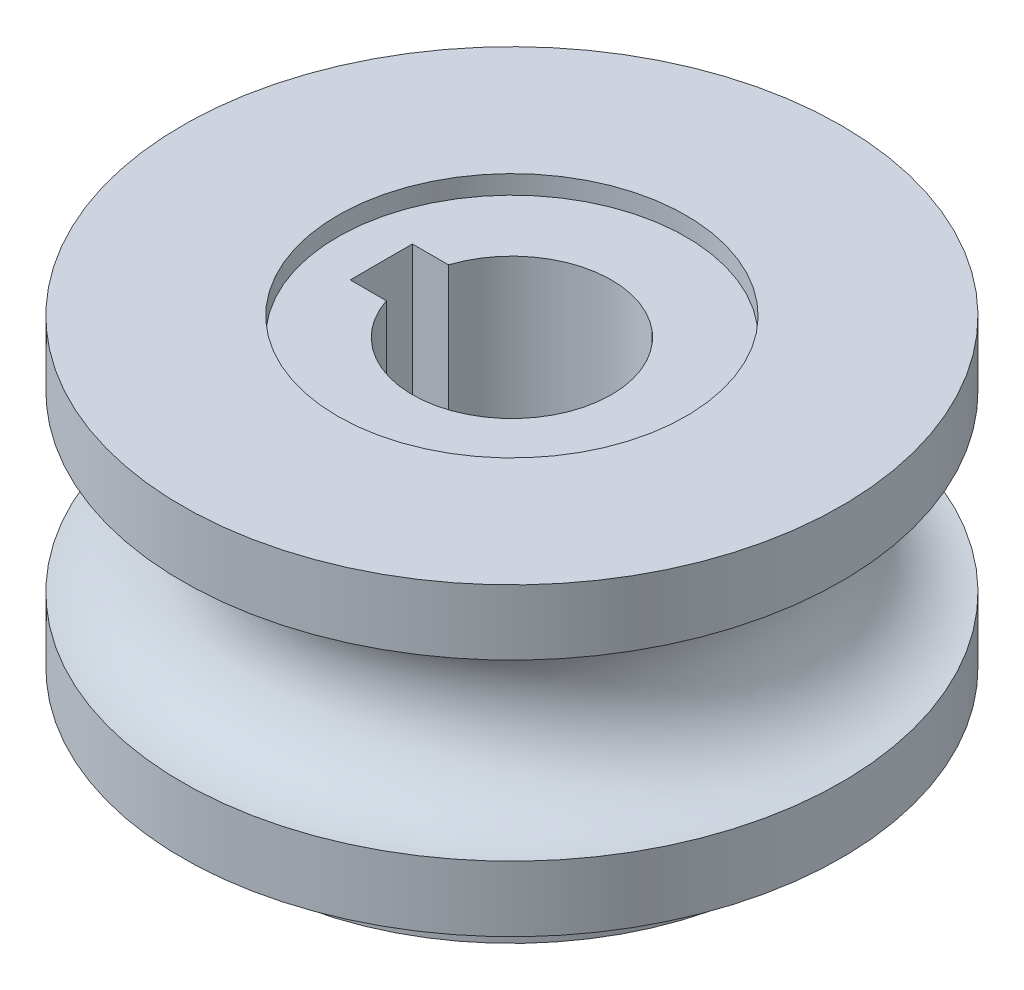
ISO-10303-21;
HEADER;
FILE_DESCRIPTION(('STEP AP214'),'2;1');
FILE_NAME('part.step','',(''),(''),'','','');
FILE_SCHEMA(('AUTOMOTIVE_DESIGN { 1 0 10303 214 1 1 1 1 }'));
ENDSEC;
DATA;
#1=APPLICATION_CONTEXT('core data for automotive mechanical design processes');
#2=APPLICATION_PROTOCOL_DEFINITION('international standard','automotive_design',2000,#1);
#3=PRODUCT_CONTEXT('',#1,'mechanical');
#4=PRODUCT('Part','Part','',(#3));
#5=PRODUCT_RELATED_PRODUCT_CATEGORY('part','',(#4));
#6=PRODUCT_DEFINITION_FORMATION('','',#4);
#7=PRODUCT_DEFINITION_CONTEXT('part definition',#1,'design');
#8=PRODUCT_DEFINITION('design','',#6,#7);
#9=PRODUCT_DEFINITION_SHAPE('','',#8);
#10=(LENGTH_UNIT() NAMED_UNIT(*) SI_UNIT(.MILLI.,.METRE.));
#11=(NAMED_UNIT(*) PLANE_ANGLE_UNIT() SI_UNIT($,.RADIAN.));
#12=(NAMED_UNIT(*) SI_UNIT($,.STERADIAN.) SOLID_ANGLE_UNIT());
#13=UNCERTAINTY_MEASURE_WITH_UNIT(LENGTH_MEASURE(1.E-05),#10,'distance_accuracy_value','');
#14=(GEOMETRIC_REPRESENTATION_CONTEXT(3) GLOBAL_UNCERTAINTY_ASSIGNED_CONTEXT((#13)) GLOBAL_UNIT_ASSIGNED_CONTEXT((#10,
#11,#12)) REPRESENTATION_CONTEXT('',''));
#15=CARTESIAN_POINT('',(0.,0.,0.));
#16=DIRECTION('',(0.,0.,1.));
#17=DIRECTION('',(1.,0.,0.));
#18=AXIS2_PLACEMENT_3D('',#15,#16,#17);
#19=CARTESIAN_POINT('',(0.,0.,0.));
#20=DIRECTION('',(0.,-1.,0.));
#21=DIRECTION('',(0.,0.,-1.));
#22=AXIS2_PLACEMENT_3D('',#19,#20,#21);
#23=PLANE('',#22);
#24=DIRECTION('',(-1.,0.,0.));
#25=VECTOR('',#24,1.);
#26=CARTESIAN_POINT('',(-5.25,0.,-1.25));
#27=LINE('',#26,#25);
#28=CARTESIAN_POINT('',(-4.58257569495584,0.,-1.25));
#29=VERTEX_POINT('',#28);
#30=CARTESIAN_POINT('',(-5.25,0.,-1.25));
#31=VERTEX_POINT('',#30);
#32=EDGE_CURVE('E91',#29,#31,#27,.T.);
#33=ORIENTED_EDGE('',*,*,#32,.T.);
#34=DIRECTION('',(0.,0.,1.));
#35=VECTOR('',#34,1.);
#36=CARTESIAN_POINT('',(-5.25,0.,-1.25));
#37=LINE('',#36,#35);
#38=CARTESIAN_POINT('',(-5.25,0.,1.25));
#39=VERTEX_POINT('',#38);
#40=EDGE_CURVE('E107',#31,#39,#37,.T.);
#41=ORIENTED_EDGE('',*,*,#40,.T.);
#42=DIRECTION('',(1.,0.,0.));
#43=VECTOR('',#42,1.);
#44=CARTESIAN_POINT('',(-5.25,0.,1.25));
#45=LINE('',#44,#43);
#46=CARTESIAN_POINT('',(-4.58257569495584,0.,1.25));
#47=VERTEX_POINT('',#46);
#48=EDGE_CURVE('E86',#39,#47,#45,.T.);
#49=ORIENTED_EDGE('',*,*,#48,.T.);
#50=CARTESIAN_POINT('',(0.,0.,0.));
#51=DIRECTION('',(0.,-1.,0.));
#52=DIRECTION('',(0.,0.,-1.));
#53=AXIS2_PLACEMENT_3D('',#50,#51,#52);
#54=CIRCLE('',#53,4.75);
#55=EDGE_CURVE('E133',#29,#47,#54,.T.);
#56=ORIENTED_EDGE('',*,*,#55,.F.);
#57=EDGE_LOOP('',(#33,#41,#49,#56));
#58=FACE_BOUND('',#57,.T.);
#59=CARTESIAN_POINT('',(0.,0.,0.));
#60=DIRECTION('',(0.,-1.,0.));
#61=DIRECTION('',(0.,0.,-1.));
#62=AXIS2_PLACEMENT_3D('',#59,#60,#61);
#63=CIRCLE('',#62,6.5);
#64=CARTESIAN_POINT('',(0.,0.,-6.5));
#65=VERTEX_POINT('',#64);
#66=EDGE_CURVE('E160',#65,#65,#63,.T.);
#67=ORIENTED_EDGE('',*,*,#66,.T.);
#68=EDGE_LOOP('',(#67));
#69=FACE_BOUND('',#68,.T.);
#70=ADVANCED_FACE('F32',(#58,#69),#23,.T.);
#71=CARTESIAN_POINT('',(0.,0.,0.));
#72=DIRECTION('',(0.,-1.,0.));
#73=DIRECTION('',(0.,0.,-1.));
#74=AXIS2_PLACEMENT_3D('',#71,#72,#73);
#75=CYLINDRICAL_SURFACE('',#74,6.5);
#76=CARTESIAN_POINT('',(0.,0.5,0.));
#77=DIRECTION('',(0.,-1.,0.));
#78=DIRECTION('',(0.,0.,-1.));
#79=AXIS2_PLACEMENT_3D('',#76,#77,#78);
#80=CIRCLE('',#79,6.5);
#81=CARTESIAN_POINT('',(0.,0.5,-6.5));
#82=VERTEX_POINT('',#81);
#83=EDGE_CURVE('E157',#82,#82,#80,.T.);
#84=ORIENTED_EDGE('',*,*,#83,.T.);
#85=EDGE_LOOP('',(#84));
#86=FACE_BOUND('',#85,.T.);
#87=ORIENTED_EDGE('',*,*,#66,.F.);
#88=EDGE_LOOP('',(#87));
#89=FACE_BOUND('',#88,.T.);
#90=ADVANCED_FACE('F184',(#86,#89),#75,.T.);
#91=CARTESIAN_POINT('',(6.5,0.5,0.));
#92=DIRECTION('',(0.,-1.,0.));
#93=DIRECTION('',(0.,0.,-1.));
#94=AXIS2_PLACEMENT_3D('',#91,#92,#93);
#95=PLANE('',#94);
#96=CARTESIAN_POINT('',(0.,0.5,0.));
#97=DIRECTION('',(0.,-1.,0.));
#98=DIRECTION('',(0.,0.,-1.));
#99=AXIS2_PLACEMENT_3D('',#96,#97,#98);
#100=CIRCLE('',#99,10.75);
#101=CARTESIAN_POINT('',(0.,0.5,-10.75));
#102=VERTEX_POINT('',#101);
#103=EDGE_CURVE('E154',#102,#102,#100,.T.);
#104=ORIENTED_EDGE('',*,*,#103,.T.);
#105=EDGE_LOOP('',(#104));
#106=FACE_BOUND('',#105,.T.);
#107=ORIENTED_EDGE('',*,*,#83,.F.);
#108=EDGE_LOOP('',(#107));
#109=FACE_BOUND('',#108,.T.);
#110=ADVANCED_FACE('F188',(#106,#109),#95,.T.);
#111=CARTESIAN_POINT('',(0.,0.,0.));
#112=DIRECTION('',(0.,-1.,0.));
#113=DIRECTION('',(0.,0.,-1.));
#114=AXIS2_PLACEMENT_3D('',#111,#112,#113);
#115=CYLINDRICAL_SURFACE('',#114,10.75);
#116=CARTESIAN_POINT('',(0.,2.5,0.));
#117=DIRECTION('',(0.,-1.,0.));
#118=DIRECTION('',(0.,0.,-1.));
#119=AXIS2_PLACEMENT_3D('',#116,#117,#118);
#120=CIRCLE('',#119,10.75);
#121=CARTESIAN_POINT('',(0.,2.5,-10.75));
#122=VERTEX_POINT('',#121);
#123=EDGE_CURVE('E151',#122,#122,#120,.T.);
#124=ORIENTED_EDGE('',*,*,#123,.T.);
#125=EDGE_LOOP('',(#124));
#126=FACE_BOUND('',#125,.T.);
#127=ORIENTED_EDGE('',*,*,#103,.F.);
#128=EDGE_LOOP('',(#127));
#129=FACE_BOUND('',#128,.T.);
#130=ADVANCED_FACE('F193',(#126,#129),#115,.T.);
#131=CARTESIAN_POINT('',(10.75,2.5,0.));
#132=DIRECTION('',(0.,-1.,0.));
#133=DIRECTION('',(0.,0.,-1.));
#134=AXIS2_PLACEMENT_3D('',#131,#132,#133);
#135=PLANE('',#134);
#136=CARTESIAN_POINT('',(0.,2.5,0.));
#137=DIRECTION('',(0.,-1.,0.));
#138=DIRECTION('',(0.,0.,-1.));
#139=AXIS2_PLACEMENT_3D('',#136,#137,#138);
#140=CIRCLE('',#139,13.25);
#141=CARTESIAN_POINT('',(0.,2.5,-13.25));
#142=VERTEX_POINT('',#141);
#143=EDGE_CURVE('E148',#142,#142,#140,.T.);
#144=ORIENTED_EDGE('',*,*,#143,.T.);
#145=EDGE_LOOP('',(#144));
#146=FACE_BOUND('',#145,.T.);
#147=ORIENTED_EDGE('',*,*,#123,.F.);
#148=EDGE_LOOP('',(#147));
#149=FACE_BOUND('',#148,.T.);
#150=ADVANCED_FACE('F200',(#146,#149),#135,.T.);
#151=CARTESIAN_POINT('',(0.,0.,0.));
#152=DIRECTION('',(0.,-1.,0.));
#153=DIRECTION('',(0.,0.,-1.));
#154=AXIS2_PLACEMENT_3D('',#151,#152,#153);
#155=CYLINDRICAL_SURFACE('',#154,13.25);
#156=CARTESIAN_POINT('',(0.,5.13,0.));
#157=DIRECTION('',(0.,-1.,0.));
#158=DIRECTION('',(0.,0.,-1.));
#159=AXIS2_PLACEMENT_3D('',#156,#157,#158);
#160=CIRCLE('',#159,13.25);
#161=CARTESIAN_POINT('',(0.,5.13,-13.25));
#162=VERTEX_POINT('',#161);
#163=EDGE_CURVE('E145',#162,#162,#160,.T.);
#164=ORIENTED_EDGE('',*,*,#163,.T.);
#165=EDGE_LOOP('',(#164));
#166=FACE_BOUND('',#165,.T.);
#167=ORIENTED_EDGE('',*,*,#143,.F.);
#168=EDGE_LOOP('',(#167));
#169=FACE_BOUND('',#168,.T.);
#170=ADVANCED_FACE('F204',(#166,#169),#155,.T.);
#171=CARTESIAN_POINT('',(0.,8.63,0.));
#172=DIRECTION('',(0.,-1.,0.));
#173=DIRECTION('',(0.,0.,-1.));
#174=AXIS2_PLACEMENT_3D('',#171,#172,#173);
#175=TOROIDAL_SURFACE('',#174,13.25,3.5);
#176=CARTESIAN_POINT('',(0.,12.13,0.));
#177=DIRECTION('',(0.,-1.,0.));
#178=DIRECTION('',(0.,0.,-1.));
#179=AXIS2_PLACEMENT_3D('',#176,#177,#178);
#180=CIRCLE('',#179,13.25);
#181=CARTESIAN_POINT('',(0.,12.13,-13.25));
#182=VERTEX_POINT('',#181);
#183=EDGE_CURVE('E142',#182,#182,#180,.T.);
#184=ORIENTED_EDGE('',*,*,#183,.T.);
#185=EDGE_LOOP('',(#184));
#186=FACE_BOUND('',#185,.T.);
#187=ORIENTED_EDGE('',*,*,#163,.F.);
#188=EDGE_LOOP('',(#187));
#189=FACE_BOUND('',#188,.T.);
#190=ADVANCED_FACE('F208',(#186,#189),#175,.F.);
#191=CARTESIAN_POINT('',(0.,0.,0.));
#192=DIRECTION('',(0.,-1.,0.));
#193=DIRECTION('',(0.,0.,-1.));
#194=AXIS2_PLACEMENT_3D('',#191,#192,#193);
#195=CYLINDRICAL_SURFACE('',#194,13.25);
#196=CARTESIAN_POINT('',(0.,14.75,0.));
#197=DIRECTION('',(0.,-1.,0.));
#198=DIRECTION('',(0.,0.,-1.));
#199=AXIS2_PLACEMENT_3D('',#196,#197,#198);
#200=CIRCLE('',#199,13.25);
#201=CARTESIAN_POINT('',(0.,14.75,-13.25));
#202=VERTEX_POINT('',#201);
#203=EDGE_CURVE('E139',#202,#202,#200,.T.);
#204=ORIENTED_EDGE('',*,*,#203,.T.);
#205=EDGE_LOOP('',(#204));
#206=FACE_BOUND('',#205,.T.);
#207=ORIENTED_EDGE('',*,*,#183,.F.);
#208=EDGE_LOOP('',(#207));
#209=FACE_BOUND('',#208,.T.);
#210=ADVANCED_FACE('F212',(#206,#209),#195,.T.);
#211=CARTESIAN_POINT('',(13.25,14.75,0.));
#212=DIRECTION('',(0.,1.,0.));
#213=DIRECTION('',(0.,0.,1.));
#214=AXIS2_PLACEMENT_3D('',#211,#212,#213);
#215=PLANE('',#214);
#216=CARTESIAN_POINT('',(0.,14.75,0.));
#217=DIRECTION('',(0.,1.,0.));
#218=DIRECTION('',(0.,0.,1.));
#219=AXIS2_PLACEMENT_3D('',#216,#217,#218);
#220=CIRCLE('',#219,7.);
#221=CARTESIAN_POINT('',(0.,14.75,7.));
#222=VERTEX_POINT('',#221);
#223=EDGE_CURVE('E127',#222,#222,#220,.T.);
#224=ORIENTED_EDGE('',*,*,#223,.F.);
#225=EDGE_LOOP('',(#224));
#226=FACE_BOUND('',#225,.T.);
#227=ORIENTED_EDGE('',*,*,#203,.F.);
#228=EDGE_LOOP('',(#227));
#229=FACE_BOUND('',#228,.T.);
#230=ADVANCED_FACE('F216',(#226,#229),#215,.T.);
#231=CARTESIAN_POINT('',(0.,0.75,0.));
#232=DIRECTION('',(0.,-1.,0.));
#233=DIRECTION('',(0.,0.,-1.));
#234=AXIS2_PLACEMENT_3D('',#231,#232,#233);
#235=CYLINDRICAL_SURFACE('',#234,4.75);
#236=CARTESIAN_POINT('',(0.,0.75,0.));
#237=DIRECTION('',(0.,-1.,0.));
#238=DIRECTION('',(0.,0.,-1.));
#239=AXIS2_PLACEMENT_3D('',#236,#237,#238);
#240=CIRCLE('',#239,4.75);
#241=CARTESIAN_POINT('',(-4.58257569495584,0.75,-1.25));
#242=VERTEX_POINT('',#241);
#243=CARTESIAN_POINT('',(-4.58257569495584,0.75,1.25));
#244=VERTEX_POINT('',#243);
#245=EDGE_CURVE('E136',#242,#244,#240,.T.);
#246=ORIENTED_EDGE('',*,*,#245,.F.);
#247=DIRECTION('',(0.,-1.,0.));
#248=VECTOR('',#247,1.);
#249=CARTESIAN_POINT('',(-4.58257569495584,0.75,-1.25));
#250=LINE('',#249,#248);
#251=EDGE_CURVE('E54',#242,#29,#250,.T.);
#252=ORIENTED_EDGE('',*,*,#251,.T.);
#253=ORIENTED_EDGE('',*,*,#55,.T.);
#254=DIRECTION('',(0.,-1.,0.));
#255=VECTOR('',#254,1.);
#256=CARTESIAN_POINT('',(-4.58257569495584,0.75,1.25));
#257=LINE('',#256,#255);
#258=EDGE_CURVE('E117',#47,#244,#257,.F.);
#259=ORIENTED_EDGE('',*,*,#258,.T.);
#260=EDGE_LOOP('',(#246,#252,#253,#259));
#261=FACE_BOUND('',#260,.T.);
#262=ADVANCED_FACE('F170',(#261),#235,.F.);
#263=CARTESIAN_POINT('',(0.,0.75,0.));
#264=DIRECTION('',(0.,-1.,0.));
#265=DIRECTION('',(0.,0.,-1.));
#266=AXIS2_PLACEMENT_3D('',#263,#264,#265);
#267=PLANE('',#266);
#268=DIRECTION('',(1.,0.,0.));
#269=VECTOR('',#268,1.);
#270=CARTESIAN_POINT('',(0.,0.75,-1.25));
#271=LINE('',#270,#269);
#272=CARTESIAN_POINT('',(-3.79967103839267,0.75,-1.25));
#273=VERTEX_POINT('',#272);
#274=EDGE_CURVE('E120',#242,#273,#271,.T.);
#275=ORIENTED_EDGE('',*,*,#274,.F.);
#276=ORIENTED_EDGE('',*,*,#245,.T.);
#277=DIRECTION('',(-1.,0.,0.));
#278=VECTOR('',#277,1.);
#279=CARTESIAN_POINT('',(0.,0.75,1.25));
#280=LINE('',#279,#278);
#281=CARTESIAN_POINT('',(-3.79967103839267,0.75,1.25));
#282=VERTEX_POINT('',#281);
#283=EDGE_CURVE('E114',#282,#244,#280,.T.);
#284=ORIENTED_EDGE('',*,*,#283,.F.);
#285=CARTESIAN_POINT('',(0.,0.75,0.));
#286=DIRECTION('',(0.,-1.,0.));
#287=DIRECTION('',(0.,0.,-1.));
#288=AXIS2_PLACEMENT_3D('',#285,#286,#287);
#289=CIRCLE('',#288,4.);
#290=EDGE_CURVE('E124',#273,#282,#289,.T.);
#291=ORIENTED_EDGE('',*,*,#290,.F.);
#292=EDGE_LOOP('',(#275,#276,#284,#291));
#293=FACE_BOUND('',#292,.T.);
#294=ADVANCED_FACE('F167',(#293),#267,.T.);
#295=CARTESIAN_POINT('',(0.,14.,0.));
#296=DIRECTION('',(0.,1.,0.));
#297=DIRECTION('',(0.,0.,1.));
#298=AXIS2_PLACEMENT_3D('',#295,#296,#297);
#299=CYLINDRICAL_SURFACE('',#298,7.);
#300=CARTESIAN_POINT('',(0.,14.,0.));
#301=DIRECTION('',(0.,1.,0.));
#302=DIRECTION('',(0.,0.,1.));
#303=AXIS2_PLACEMENT_3D('',#300,#301,#302);
#304=CIRCLE('',#303,7.);
#305=CARTESIAN_POINT('',(0.,14.,7.));
#306=VERTEX_POINT('',#305);
#307=EDGE_CURVE('E130',#306,#306,#304,.T.);
#308=ORIENTED_EDGE('',*,*,#307,.F.);
#309=EDGE_LOOP('',(#308));
#310=FACE_BOUND('',#309,.T.);
#311=ORIENTED_EDGE('',*,*,#223,.T.);
#312=EDGE_LOOP('',(#311));
#313=FACE_BOUND('',#312,.T.);
#314=ADVANCED_FACE('F225',(#310,#313),#299,.F.);
#315=CARTESIAN_POINT('',(0.,14.,0.));
#316=DIRECTION('',(0.,1.,0.));
#317=DIRECTION('',(0.,0.,1.));
#318=AXIS2_PLACEMENT_3D('',#315,#316,#317);
#319=PLANE('',#318);
#320=DIRECTION('',(-1.,0.,0.));
#321=VECTOR('',#320,1.);
#322=CARTESIAN_POINT('',(-5.25,14.,-1.25));
#323=LINE('',#322,#321);
#324=CARTESIAN_POINT('',(-3.79967103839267,14.,-1.25));
#325=VERTEX_POINT('',#324);
#326=CARTESIAN_POINT('',(-5.25,14.,-1.25));
#327=VERTEX_POINT('',#326);
#328=EDGE_CURVE('E105',#325,#327,#323,.T.);
#329=ORIENTED_EDGE('',*,*,#328,.F.);
#330=CARTESIAN_POINT('',(0.,14.,0.));
#331=DIRECTION('',(0.,1.,0.));
#332=DIRECTION('',(0.,0.,1.));
#333=AXIS2_PLACEMENT_3D('',#330,#331,#332);
#334=CIRCLE('',#333,4.);
#335=CARTESIAN_POINT('',(-3.79967103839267,14.,1.25));
#336=VERTEX_POINT('',#335);
#337=EDGE_CURVE('E104',#336,#325,#334,.T.);
#338=ORIENTED_EDGE('',*,*,#337,.F.);
#339=DIRECTION('',(1.,0.,0.));
#340=VECTOR('',#339,1.);
#341=CARTESIAN_POINT('',(-5.25,14.,1.25));
#342=LINE('',#341,#340);
#343=CARTESIAN_POINT('',(-5.25,14.,1.25));
#344=VERTEX_POINT('',#343);
#345=EDGE_CURVE('E46',#344,#336,#342,.T.);
#346=ORIENTED_EDGE('',*,*,#345,.F.);
#347=DIRECTION('',(0.,0.,1.));
#348=VECTOR('',#347,1.);
#349=CARTESIAN_POINT('',(-5.25,14.,-1.25));
#350=LINE('',#349,#348);
#351=EDGE_CURVE('E94',#327,#344,#350,.T.);
#352=ORIENTED_EDGE('',*,*,#351,.F.);
#353=EDGE_LOOP('',(#329,#338,#346,#352));
#354=FACE_BOUND('',#353,.T.);
#355=ORIENTED_EDGE('',*,*,#307,.T.);
#356=EDGE_LOOP('',(#355));
#357=FACE_BOUND('',#356,.T.);
#358=ADVANCED_FACE('F101',(#354,#357),#319,.T.);
#359=CARTESIAN_POINT('',(0.,0.,0.));
#360=DIRECTION('',(0.,1.,0.));
#361=DIRECTION('',(0.,0.,1.));
#362=AXIS2_PLACEMENT_3D('',#359,#360,#361);
#363=CYLINDRICAL_SURFACE('',#362,4.);
#364=ORIENTED_EDGE('',*,*,#337,.T.);
#365=DIRECTION('',(0.,1.,0.));
#366=VECTOR('',#365,1.);
#367=CARTESIAN_POINT('',(-3.79967103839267,0.,-1.25));
#368=LINE('',#367,#366);
#369=EDGE_CURVE('E11',#325,#273,#368,.F.);
#370=ORIENTED_EDGE('',*,*,#369,.T.);
#371=ORIENTED_EDGE('',*,*,#290,.T.);
#372=DIRECTION('',(0.,1.,0.));
#373=VECTOR('',#372,1.);
#374=CARTESIAN_POINT('',(-3.79967103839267,0.,1.25));
#375=LINE('',#374,#373);
#376=EDGE_CURVE('E39',#282,#336,#375,.T.);
#377=ORIENTED_EDGE('',*,*,#376,.T.);
#378=EDGE_LOOP('',(#364,#370,#371,#377));
#379=FACE_BOUND('',#378,.T.);
#380=ADVANCED_FACE('F163',(#379),#363,.F.);
#381=CARTESIAN_POINT('',(-5.25,0.,-1.25));
#382=DIRECTION('',(0.,0.,-1.));
#383=DIRECTION('',(-1.,0.,0.));
#384=AXIS2_PLACEMENT_3D('',#381,#382,#383);
#385=PLANE('',#384);
#386=ORIENTED_EDGE('',*,*,#274,.T.);
#387=ORIENTED_EDGE('',*,*,#369,.F.);
#388=ORIENTED_EDGE('',*,*,#328,.T.);
#389=DIRECTION('',(0.,1.,0.));
#390=VECTOR('',#389,1.);
#391=CARTESIAN_POINT('',(-5.25,0.,-1.25));
#392=LINE('',#391,#390);
#393=EDGE_CURVE('E90',#31,#327,#392,.T.);
#394=ORIENTED_EDGE('',*,*,#393,.F.);
#395=ORIENTED_EDGE('',*,*,#32,.F.);
#396=ORIENTED_EDGE('',*,*,#251,.F.);
#397=EDGE_LOOP('',(#386,#387,#388,#394,#395,#396));
#398=FACE_BOUND('',#397,.T.);
#399=ADVANCED_FACE('F174',(#398),#385,.F.);
#400=CARTESIAN_POINT('',(-5.25,0.,1.25));
#401=DIRECTION('',(0.,0.,1.));
#402=DIRECTION('',(1.,0.,0.));
#403=AXIS2_PLACEMENT_3D('',#400,#401,#402);
#404=PLANE('',#403);
#405=ORIENTED_EDGE('',*,*,#48,.F.);
#406=DIRECTION('',(0.,1.,0.));
#407=VECTOR('',#406,1.);
#408=CARTESIAN_POINT('',(-5.25,0.,1.25));
#409=LINE('',#408,#407);
#410=EDGE_CURVE('E82',#39,#344,#409,.T.);
#411=ORIENTED_EDGE('',*,*,#410,.T.);
#412=ORIENTED_EDGE('',*,*,#345,.T.);
#413=ORIENTED_EDGE('',*,*,#376,.F.);
#414=ORIENTED_EDGE('',*,*,#283,.T.);
#415=ORIENTED_EDGE('',*,*,#258,.F.);
#416=EDGE_LOOP('',(#405,#411,#412,#413,#414,#415));
#417=FACE_BOUND('',#416,.T.);
#418=ADVANCED_FACE('F84',(#417),#404,.F.);
#419=CARTESIAN_POINT('',(-5.25,0.,-1.25));
#420=DIRECTION('',(-1.,0.,0.));
#421=DIRECTION('',(0.,0.,1.));
#422=AXIS2_PLACEMENT_3D('',#419,#420,#421);
#423=PLANE('',#422);
#424=ORIENTED_EDGE('',*,*,#351,.T.);
#425=ORIENTED_EDGE('',*,*,#410,.F.);
#426=ORIENTED_EDGE('',*,*,#40,.F.);
#427=ORIENTED_EDGE('',*,*,#393,.T.);
#428=EDGE_LOOP('',(#424,#425,#426,#427));
#429=FACE_BOUND('',#428,.T.);
#430=ADVANCED_FACE('F95',(#429),#423,.F.);
#431=CLOSED_SHELL('',(#70,#90,#110,#130,#150,#170,#190,#210,#230,#262,#294,#314,#358,#380,#399,
#418,#430));
#432=MANIFOLD_SOLID_BREP('B2',#431);
#433=ADVANCED_BREP_SHAPE_REPRESENTATION('',(#18,#432),#14);
#434=SHAPE_DEFINITION_REPRESENTATION(#9,#433);
ENDSEC;
END-ISO-10303-21;
